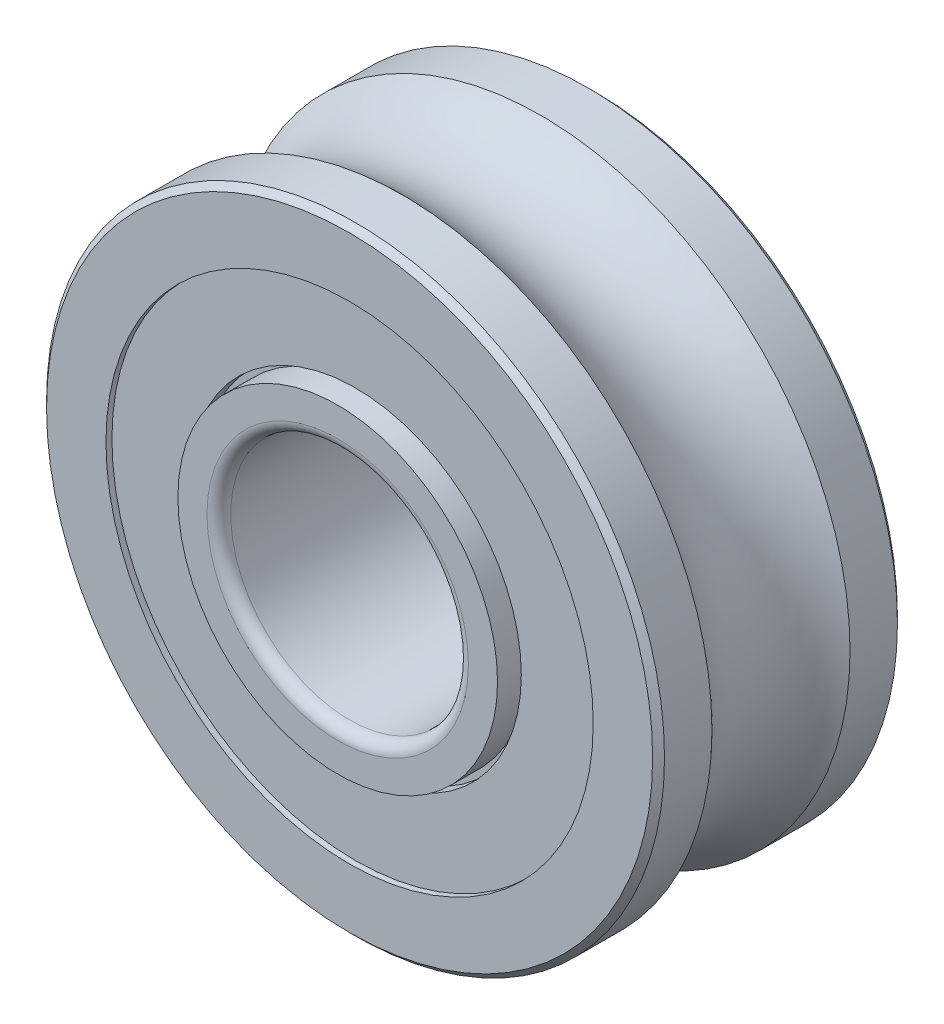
ISO-10303-21;
HEADER;
FILE_DESCRIPTION(('STEP AP214'),'2;1');
FILE_NAME('part.step','',(''),(''),'','','');
FILE_SCHEMA(('AUTOMOTIVE_DESIGN { 1 0 10303 214 1 1 1 1 }'));
ENDSEC;
DATA;
#1=APPLICATION_CONTEXT('core data for automotive mechanical design processes');
#2=APPLICATION_PROTOCOL_DEFINITION('international standard','automotive_design',2000,#1);
#3=PRODUCT_CONTEXT('',#1,'mechanical');
#4=PRODUCT('Part','Part','',(#3));
#5=PRODUCT_RELATED_PRODUCT_CATEGORY('part','',(#4));
#6=PRODUCT_DEFINITION_FORMATION('','',#4);
#7=PRODUCT_DEFINITION_CONTEXT('part definition',#1,'design');
#8=PRODUCT_DEFINITION('design','',#6,#7);
#9=PRODUCT_DEFINITION_SHAPE('','',#8);
#10=(LENGTH_UNIT() NAMED_UNIT(*) SI_UNIT(.MILLI.,.METRE.));
#11=(NAMED_UNIT(*) PLANE_ANGLE_UNIT() SI_UNIT($,.RADIAN.));
#12=(NAMED_UNIT(*) SI_UNIT($,.STERADIAN.) SOLID_ANGLE_UNIT());
#13=UNCERTAINTY_MEASURE_WITH_UNIT(LENGTH_MEASURE(1.E-05),#10,'distance_accuracy_value','');
#14=(GEOMETRIC_REPRESENTATION_CONTEXT(3) GLOBAL_UNCERTAINTY_ASSIGNED_CONTEXT((#13)) GLOBAL_UNIT_ASSIGNED_CONTEXT((#10,
#11,#12)) REPRESENTATION_CONTEXT('',''));
#15=CARTESIAN_POINT('',(0.,0.,0.));
#16=DIRECTION('',(0.,0.,1.));
#17=DIRECTION('',(1.,0.,0.));
#18=AXIS2_PLACEMENT_3D('',#15,#16,#17);
#19=CARTESIAN_POINT('',(0.,0.,38.6779652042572));
#20=DIRECTION('',(0.,0.,1.));
#21=DIRECTION('',(1.,0.,0.));
#22=AXIS2_PLACEMENT_3D('',#19,#20,#21);
#23=CYLINDRICAL_SURFACE('',#22,13.45);
#24=CARTESIAN_POINT('',(0.,0.,-8.8));
#25=DIRECTION('',(0.,0.,1.));
#26=DIRECTION('',(1.,0.,0.));
#27=AXIS2_PLACEMENT_3D('',#24,#25,#26);
#28=CIRCLE('',#27,13.45);
#29=CARTESIAN_POINT('',(13.45,0.,-8.8));
#30=VERTEX_POINT('',#29);
#31=EDGE_CURVE('E194',#30,#30,#28,.F.);
#32=ORIENTED_EDGE('',*,*,#31,.T.);
#33=EDGE_LOOP('',(#32));
#34=FACE_BOUND('',#33,.T.);
#35=CARTESIAN_POINT('',(0.,0.,-11.3));
#36=DIRECTION('',(0.,0.,1.));
#37=DIRECTION('',(1.,0.,0.));
#38=AXIS2_PLACEMENT_3D('',#35,#36,#37);
#39=CIRCLE('',#38,13.45);
#40=CARTESIAN_POINT('',(13.45,0.,-11.3));
#41=VERTEX_POINT('',#40);
#42=EDGE_CURVE('E197',#41,#41,#39,.T.);
#43=ORIENTED_EDGE('',*,*,#42,.T.);
#44=EDGE_LOOP('',(#43));
#45=FACE_BOUND('',#44,.T.);
#46=ADVANCED_FACE('F14',(#34,#45),#23,.T.);
#47=CARTESIAN_POINT('',(0.,13.45,-8.8));
#48=DIRECTION('',(0.,0.,1.));
#49=DIRECTION('',(1.,0.,0.));
#50=AXIS2_PLACEMENT_3D('',#47,#48,#49);
#51=PLANE('',#50);
#52=ORIENTED_EDGE('',*,*,#31,.F.);
#53=EDGE_LOOP('',(#52));
#54=FACE_BOUND('',#53,.T.);
#55=CARTESIAN_POINT('',(0.,0.,-8.8));
#56=DIRECTION('',(0.,0.,1.));
#57=DIRECTION('',(1.,0.,0.));
#58=AXIS2_PLACEMENT_3D('',#55,#56,#57);
#59=CIRCLE('',#58,13.95);
#60=CARTESIAN_POINT('',(13.95,0.,-8.8));
#61=VERTEX_POINT('',#60);
#62=EDGE_CURVE('E56',#61,#61,#59,.F.);
#63=ORIENTED_EDGE('',*,*,#62,.T.);
#64=EDGE_LOOP('',(#63));
#65=FACE_BOUND('',#64,.T.);
#66=ADVANCED_FACE('F73',(#54,#65),#51,.F.);
#67=CARTESIAN_POINT('',(0.,13.45,-11.3));
#68=DIRECTION('',(0.,0.,1.));
#69=DIRECTION('',(1.,0.,0.));
#70=AXIS2_PLACEMENT_3D('',#67,#68,#69);
#71=PLANE('',#70);
#72=CARTESIAN_POINT('',(0.,0.,-11.3));
#73=DIRECTION('',(0.,0.,-1.));
#74=DIRECTION('',(1.,0.,0.));
#75=AXIS2_PLACEMENT_3D('',#72,#73,#74);
#76=CIRCLE('',#75,11.);
#77=CARTESIAN_POINT('',(11.,0.,-11.3));
#78=VERTEX_POINT('',#77);
#79=CARTESIAN_POINT('',(-11.,0.,-11.3));
#80=VERTEX_POINT('',#79);
#81=EDGE_CURVE('E42',#78,#80,#76,.T.);
#82=ORIENTED_EDGE('',*,*,#81,.F.);
#83=CARTESIAN_POINT('',(0.,0.,-11.3));
#84=DIRECTION('',(0.,0.,-1.));
#85=DIRECTION('',(-1.,0.,0.));
#86=AXIS2_PLACEMENT_3D('',#83,#84,#85);
#87=CIRCLE('',#86,11.);
#88=EDGE_CURVE('E44',#80,#78,#87,.T.);
#89=ORIENTED_EDGE('',*,*,#88,.F.);
#90=EDGE_LOOP('',(#82,#89));
#91=FACE_BOUND('',#90,.T.);
#92=ORIENTED_EDGE('',*,*,#42,.F.);
#93=EDGE_LOOP('',(#92));
#94=FACE_BOUND('',#93,.T.);
#95=ADVANCED_FACE('F54',(#91,#94),#71,.F.);
#96=CARTESIAN_POINT('',(0.,0.,38.6779652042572));
#97=DIRECTION('',(0.,0.,1.));
#98=DIRECTION('',(1.,0.,0.));
#99=AXIS2_PLACEMENT_3D('',#96,#97,#98);
#100=CYLINDRICAL_SURFACE('',#99,13.95);
#101=CARTESIAN_POINT('',(0.,0.,-9.8));
#102=DIRECTION('',(0.,0.,1.));
#103=DIRECTION('',(1.,0.,0.));
#104=AXIS2_PLACEMENT_3D('',#101,#102,#103);
#105=CIRCLE('',#104,13.95);
#106=CARTESIAN_POINT('',(13.95,0.,-9.8));
#107=VERTEX_POINT('',#106);
#108=EDGE_CURVE('E50',#107,#107,#105,.F.);
#109=ORIENTED_EDGE('',*,*,#108,.T.);
#110=EDGE_LOOP('',(#109));
#111=FACE_BOUND('',#110,.T.);
#112=ORIENTED_EDGE('',*,*,#62,.F.);
#113=EDGE_LOOP('',(#112));
#114=FACE_BOUND('',#113,.T.);
#115=ADVANCED_FACE('F72',(#111,#114),#100,.F.);
#116=CARTESIAN_POINT('',(0.,0.,-10.3));
#117=DIRECTION('',(0.,0.,1.));
#118=DIRECTION('',(1.,0.,0.));
#119=AXIS2_PLACEMENT_3D('',#116,#117,#118);
#120=TOROIDAL_SURFACE('',#119,11.,1.);
#121=ORIENTED_EDGE('',*,*,#81,.T.);
#122=ORIENTED_EDGE('',*,*,#88,.T.);
#123=EDGE_LOOP('',(#121,#122));
#124=FACE_BOUND('',#123,.T.);
#125=CARTESIAN_POINT('',(0.,0.,-10.3));
#126=DIRECTION('',(0.,0.,1.));
#127=DIRECTION('',(1.,0.,0.));
#128=AXIS2_PLACEMENT_3D('',#125,#126,#127);
#129=CIRCLE('',#128,10.);
#130=CARTESIAN_POINT('',(10.,0.,-10.3));
#131=VERTEX_POINT('',#130);
#132=EDGE_CURVE('E204',#131,#131,#129,.T.);
#133=ORIENTED_EDGE('',*,*,#132,.T.);
#134=EDGE_LOOP('',(#133));
#135=FACE_BOUND('',#134,.T.);
#136=ADVANCED_FACE('F46',(#124,#135),#120,.T.);
#137=CARTESIAN_POINT('',(0.,20.5,-9.8));
#138=DIRECTION('',(0.,0.,1.));
#139=DIRECTION('',(1.,0.,0.));
#140=AXIS2_PLACEMENT_3D('',#137,#138,#139);
#141=PLANE('',#140);
#142=ORIENTED_EDGE('',*,*,#108,.F.);
#143=EDGE_LOOP('',(#142));
#144=FACE_BOUND('',#143,.T.);
#145=CARTESIAN_POINT('',(0.,0.,-9.8));
#146=DIRECTION('',(0.,0.,1.));
#147=DIRECTION('',(1.,0.,0.));
#148=AXIS2_PLACEMENT_3D('',#145,#146,#147);
#149=CIRCLE('',#148,20.5);
#150=CARTESIAN_POINT('',(20.5,0.,-9.8));
#151=VERTEX_POINT('',#150);
#152=EDGE_CURVE('E205',#151,#151,#149,.F.);
#153=ORIENTED_EDGE('',*,*,#152,.T.);
#154=EDGE_LOOP('',(#153));
#155=FACE_BOUND('',#154,.T.);
#156=ADVANCED_FACE('F239',(#144,#155),#141,.F.);
#157=CARTESIAN_POINT('',(0.,0.,38.6779652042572));
#158=DIRECTION('',(0.,0.,1.));
#159=DIRECTION('',(1.,0.,0.));
#160=AXIS2_PLACEMENT_3D('',#157,#158,#159);
#161=CYLINDRICAL_SURFACE('',#160,10.);
#162=ORIENTED_EDGE('',*,*,#132,.F.);
#163=EDGE_LOOP('',(#162));
#164=FACE_BOUND('',#163,.T.);
#165=CARTESIAN_POINT('',(0.,0.,10.3));
#166=DIRECTION('',(0.,0.,1.));
#167=DIRECTION('',(1.,0.,0.));
#168=AXIS2_PLACEMENT_3D('',#165,#166,#167);
#169=CIRCLE('',#168,10.);
#170=CARTESIAN_POINT('',(10.,0.,10.3));
#171=VERTEX_POINT('',#170);
#172=EDGE_CURVE('E208',#171,#171,#169,.F.);
#173=ORIENTED_EDGE('',*,*,#172,.F.);
#174=EDGE_LOOP('',(#173));
#175=FACE_BOUND('',#174,.T.);
#176=ADVANCED_FACE('F242',(#164,#175),#161,.F.);
#177=CARTESIAN_POINT('',(0.,0.,38.6779652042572));
#178=DIRECTION('',(0.,0.,1.));
#179=DIRECTION('',(1.,0.,0.));
#180=AXIS2_PLACEMENT_3D('',#177,#178,#179);
#181=CYLINDRICAL_SURFACE('',#180,20.5);
#182=CARTESIAN_POINT('',(0.,0.,-10.3));
#183=DIRECTION('',(0.,0.,1.));
#184=DIRECTION('',(1.,0.,0.));
#185=AXIS2_PLACEMENT_3D('',#182,#183,#184);
#186=CIRCLE('',#185,20.5);
#187=CARTESIAN_POINT('',(20.5,0.,-10.3));
#188=VERTEX_POINT('',#187);
#189=EDGE_CURVE('E209',#188,#188,#186,.F.);
#190=ORIENTED_EDGE('',*,*,#189,.T.);
#191=EDGE_LOOP('',(#190));
#192=FACE_BOUND('',#191,.T.);
#193=ORIENTED_EDGE('',*,*,#152,.F.);
#194=EDGE_LOOP('',(#193));
#195=FACE_BOUND('',#194,.T.);
#196=ADVANCED_FACE('F176',(#192,#195),#181,.F.);
#197=CARTESIAN_POINT('',(0.,0.,10.3));
#198=DIRECTION('',(0.,0.,1.));
#199=DIRECTION('',(1.,0.,0.));
#200=AXIS2_PLACEMENT_3D('',#197,#198,#199);
#201=TOROIDAL_SURFACE('',#200,11.,1.);
#202=ORIENTED_EDGE('',*,*,#172,.T.);
#203=EDGE_LOOP('',(#202));
#204=FACE_BOUND('',#203,.T.);
#205=CARTESIAN_POINT('',(0.,0.,11.3));
#206=DIRECTION('',(0.,0.,1.));
#207=DIRECTION('',(1.,0.,0.));
#208=AXIS2_PLACEMENT_3D('',#205,#206,#207);
#209=CIRCLE('',#208,11.);
#210=CARTESIAN_POINT('',(11.,0.,11.3));
#211=VERTEX_POINT('',#210);
#212=CARTESIAN_POINT('',(-11.,0.,11.3));
#213=VERTEX_POINT('',#212);
#214=EDGE_CURVE('E33',#211,#213,#209,.T.);
#215=ORIENTED_EDGE('',*,*,#214,.T.);
#216=CARTESIAN_POINT('',(0.,0.,11.3));
#217=DIRECTION('',(0.,0.,1.));
#218=DIRECTION('',(-1.,0.,0.));
#219=AXIS2_PLACEMENT_3D('',#216,#217,#218);
#220=CIRCLE('',#219,11.);
#221=EDGE_CURVE('E140',#213,#211,#220,.T.);
#222=ORIENTED_EDGE('',*,*,#221,.T.);
#223=EDGE_LOOP('',(#215,#222));
#224=FACE_BOUND('',#223,.T.);
#225=ADVANCED_FACE('F172',(#204,#224),#201,.T.);
#226=CARTESIAN_POINT('',(0.,25.5,-10.3));
#227=DIRECTION('',(0.,0.,1.));
#228=DIRECTION('',(1.,0.,0.));
#229=AXIS2_PLACEMENT_3D('',#226,#227,#228);
#230=PLANE('',#229);
#231=ORIENTED_EDGE('',*,*,#189,.F.);
#232=EDGE_LOOP('',(#231));
#233=FACE_BOUND('',#232,.T.);
#234=CARTESIAN_POINT('',(0.,0.,-10.3));
#235=DIRECTION('',(0.,0.,1.));
#236=DIRECTION('',(1.,0.,0.));
#237=AXIS2_PLACEMENT_3D('',#234,#235,#236);
#238=CIRCLE('',#237,25.5);
#239=CARTESIAN_POINT('',(25.5,0.,-10.3));
#240=VERTEX_POINT('',#239);
#241=EDGE_CURVE('E212',#240,#240,#238,.T.);
#242=ORIENTED_EDGE('',*,*,#241,.F.);
#243=EDGE_LOOP('',(#242));
#244=FACE_BOUND('',#243,.T.);
#245=ADVANCED_FACE('F156',(#233,#244),#230,.F.);
#246=CARTESIAN_POINT('',(0.,13.45,11.3));
#247=DIRECTION('',(0.,0.,-1.));
#248=DIRECTION('',(-1.,0.,0.));
#249=AXIS2_PLACEMENT_3D('',#246,#247,#248);
#250=PLANE('',#249);
#251=CARTESIAN_POINT('',(0.,0.,11.3));
#252=DIRECTION('',(0.,0.,1.));
#253=DIRECTION('',(1.,0.,0.));
#254=AXIS2_PLACEMENT_3D('',#251,#252,#253);
#255=CIRCLE('',#254,13.45);
#256=CARTESIAN_POINT('',(13.45,0.,11.3));
#257=VERTEX_POINT('',#256);
#258=EDGE_CURVE('E138',#257,#257,#255,.F.);
#259=ORIENTED_EDGE('',*,*,#258,.F.);
#260=EDGE_LOOP('',(#259));
#261=FACE_BOUND('',#260,.T.);
#262=ORIENTED_EDGE('',*,*,#221,.F.);
#263=ORIENTED_EDGE('',*,*,#214,.F.);
#264=EDGE_LOOP('',(#262,#263));
#265=FACE_BOUND('',#264,.T.);
#266=ADVANCED_FACE('F145',(#261,#265),#250,.F.);
#267=CARTESIAN_POINT('',(0.,0.,-9.8));
#268=DIRECTION('',(0.,0.,1.));
#269=DIRECTION('',(1.,0.,0.));
#270=AXIS2_PLACEMENT_3D('',#267,#268,#269);
#271=CONICAL_SURFACE('',#270,26.,0.785398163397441);
#272=ORIENTED_EDGE('',*,*,#241,.T.);
#273=EDGE_LOOP('',(#272));
#274=FACE_BOUND('',#273,.T.);
#275=CARTESIAN_POINT('',(0.,0.,-9.8));
#276=DIRECTION('',(0.,0.,1.));
#277=DIRECTION('',(1.,0.,0.));
#278=AXIS2_PLACEMENT_3D('',#275,#276,#277);
#279=CIRCLE('',#278,26.);
#280=CARTESIAN_POINT('',(26.,0.,-9.8));
#281=VERTEX_POINT('',#280);
#282=EDGE_CURVE('E135',#281,#281,#279,.T.);
#283=ORIENTED_EDGE('',*,*,#282,.F.);
#284=EDGE_LOOP('',(#283));
#285=FACE_BOUND('',#284,.T.);
#286=ADVANCED_FACE('F155',(#274,#285),#271,.T.);
#287=CARTESIAN_POINT('',(0.,0.,38.6779652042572));
#288=DIRECTION('',(0.,0.,1.));
#289=DIRECTION('',(1.,0.,0.));
#290=AXIS2_PLACEMENT_3D('',#287,#288,#289);
#291=CYLINDRICAL_SURFACE('',#290,13.45);
#292=ORIENTED_EDGE('',*,*,#258,.T.);
#293=EDGE_LOOP('',(#292));
#294=FACE_BOUND('',#293,.T.);
#295=CARTESIAN_POINT('',(0.,0.,8.8));
#296=DIRECTION('',(0.,0.,1.));
#297=DIRECTION('',(1.,0.,0.));
#298=AXIS2_PLACEMENT_3D('',#295,#296,#297);
#299=CIRCLE('',#298,13.45);
#300=CARTESIAN_POINT('',(13.45,0.,8.8));
#301=VERTEX_POINT('',#300);
#302=EDGE_CURVE('E134',#301,#301,#299,.T.);
#303=ORIENTED_EDGE('',*,*,#302,.T.);
#304=EDGE_LOOP('',(#303));
#305=FACE_BOUND('',#304,.T.);
#306=ADVANCED_FACE('F270',(#294,#305),#291,.T.);
#307=CARTESIAN_POINT('',(0.,0.,38.6779652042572));
#308=DIRECTION('',(0.,0.,1.));
#309=DIRECTION('',(1.,0.,0.));
#310=AXIS2_PLACEMENT_3D('',#307,#308,#309);
#311=CYLINDRICAL_SURFACE('',#310,26.);
#312=ORIENTED_EDGE('',*,*,#282,.T.);
#313=EDGE_LOOP('',(#312));
#314=FACE_BOUND('',#313,.T.);
#315=CARTESIAN_POINT('',(0.,0.,-5.80947501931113));
#316=DIRECTION('',(0.,0.,1.));
#317=DIRECTION('',(1.,0.,0.));
#318=AXIS2_PLACEMENT_3D('',#315,#316,#317);
#319=CIRCLE('',#318,26.);
#320=CARTESIAN_POINT('',(26.,0.,-5.80947501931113));
#321=VERTEX_POINT('',#320);
#322=EDGE_CURVE('E130',#321,#321,#319,.F.);
#323=ORIENTED_EDGE('',*,*,#322,.T.);
#324=EDGE_LOOP('',(#323));
#325=FACE_BOUND('',#324,.T.);
#326=ADVANCED_FACE('F273',(#314,#325),#311,.T.);
#327=CARTESIAN_POINT('',(0.,13.45,8.8));
#328=DIRECTION('',(0.,0.,-1.));
#329=DIRECTION('',(-1.,0.,0.));
#330=AXIS2_PLACEMENT_3D('',#327,#328,#329);
#331=PLANE('',#330);
#332=CARTESIAN_POINT('',(0.,0.,8.8));
#333=DIRECTION('',(0.,0.,1.));
#334=DIRECTION('',(1.,0.,0.));
#335=AXIS2_PLACEMENT_3D('',#332,#333,#334);
#336=CIRCLE('',#335,13.95);
#337=CARTESIAN_POINT('',(13.95,0.,8.8));
#338=VERTEX_POINT('',#337);
#339=EDGE_CURVE('E133',#338,#338,#336,.T.);
#340=ORIENTED_EDGE('',*,*,#339,.T.);
#341=EDGE_LOOP('',(#340));
#342=FACE_BOUND('',#341,.T.);
#343=ORIENTED_EDGE('',*,*,#302,.F.);
#344=EDGE_LOOP('',(#343));
#345=FACE_BOUND('',#344,.T.);
#346=ADVANCED_FACE('F276',(#342,#345),#331,.F.);
#347=CARTESIAN_POINT('',(0.,0.,38.6779652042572));
#348=DIRECTION('',(0.,0.,1.));
#349=DIRECTION('',(1.,0.,0.));
#350=AXIS2_PLACEMENT_3D('',#347,#348,#349);
#351=CYLINDRICAL_SURFACE('',#350,13.95);
#352=ORIENTED_EDGE('',*,*,#339,.F.);
#353=EDGE_LOOP('',(#352));
#354=FACE_BOUND('',#353,.T.);
#355=CARTESIAN_POINT('',(0.,0.,9.8));
#356=DIRECTION('',(0.,0.,1.));
#357=DIRECTION('',(1.,0.,0.));
#358=AXIS2_PLACEMENT_3D('',#355,#356,#357);
#359=CIRCLE('',#358,13.95);
#360=CARTESIAN_POINT('',(13.95,0.,9.8));
#361=VERTEX_POINT('',#360);
#362=EDGE_CURVE('E221',#361,#361,#359,.T.);
#363=ORIENTED_EDGE('',*,*,#362,.T.);
#364=EDGE_LOOP('',(#363));
#365=FACE_BOUND('',#364,.T.);
#366=ADVANCED_FACE('F122',(#354,#365),#351,.F.);
#367=CARTESIAN_POINT('',(0.,0.,0.));
#368=DIRECTION('',(0.,0.,1.));
#369=DIRECTION('',(1.,0.,0.));
#370=AXIS2_PLACEMENT_3D('',#367,#368,#369);
#371=TOROIDAL_SURFACE('',#370,31.5,8.);
#372=ORIENTED_EDGE('',*,*,#322,.F.);
#373=EDGE_LOOP('',(#372));
#374=FACE_BOUND('',#373,.T.);
#375=CARTESIAN_POINT('',(0.,0.,5.80947501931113));
#376=DIRECTION('',(0.,0.,1.));
#377=DIRECTION('',(1.,0.,0.));
#378=AXIS2_PLACEMENT_3D('',#375,#376,#377);
#379=CIRCLE('',#378,26.);
#380=CARTESIAN_POINT('',(26.,0.,5.80947501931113));
#381=VERTEX_POINT('',#380);
#382=EDGE_CURVE('E128',#381,#381,#379,.T.);
#383=ORIENTED_EDGE('',*,*,#382,.F.);
#384=EDGE_LOOP('',(#383));
#385=FACE_BOUND('',#384,.T.);
#386=ADVANCED_FACE('F117',(#374,#385),#371,.F.);
#387=CARTESIAN_POINT('',(0.,20.5,9.8));
#388=DIRECTION('',(0.,0.,-1.));
#389=DIRECTION('',(-1.,0.,0.));
#390=AXIS2_PLACEMENT_3D('',#387,#388,#389);
#391=PLANE('',#390);
#392=CARTESIAN_POINT('',(0.,0.,9.8));
#393=DIRECTION('',(0.,0.,1.));
#394=DIRECTION('',(1.,0.,0.));
#395=AXIS2_PLACEMENT_3D('',#392,#393,#394);
#396=CIRCLE('',#395,20.5);
#397=CARTESIAN_POINT('',(20.5,0.,9.8));
#398=VERTEX_POINT('',#397);
#399=EDGE_CURVE('E224',#398,#398,#396,.T.);
#400=ORIENTED_EDGE('',*,*,#399,.T.);
#401=EDGE_LOOP('',(#400));
#402=FACE_BOUND('',#401,.T.);
#403=ORIENTED_EDGE('',*,*,#362,.F.);
#404=EDGE_LOOP('',(#403));
#405=FACE_BOUND('',#404,.T.);
#406=ADVANCED_FACE('F113',(#402,#405),#391,.F.);
#407=CARTESIAN_POINT('',(0.,0.,38.6779652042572));
#408=DIRECTION('',(0.,0.,1.));
#409=DIRECTION('',(1.,0.,0.));
#410=AXIS2_PLACEMENT_3D('',#407,#408,#409);
#411=CYLINDRICAL_SURFACE('',#410,26.);
#412=ORIENTED_EDGE('',*,*,#382,.T.);
#413=EDGE_LOOP('',(#412));
#414=FACE_BOUND('',#413,.T.);
#415=CARTESIAN_POINT('',(0.,0.,9.8));
#416=DIRECTION('',(0.,0.,-1.));
#417=DIRECTION('',(-1.,0.,0.));
#418=AXIS2_PLACEMENT_3D('',#415,#416,#417);
#419=CIRCLE('',#418,26.);
#420=CARTESIAN_POINT('',(-26.,0.,9.8));
#421=VERTEX_POINT('',#420);
#422=EDGE_CURVE('E227',#421,#421,#419,.F.);
#423=ORIENTED_EDGE('',*,*,#422,.F.);
#424=EDGE_LOOP('',(#423));
#425=FACE_BOUND('',#424,.T.);
#426=ADVANCED_FACE('F109',(#414,#425),#411,.T.);
#427=CARTESIAN_POINT('',(0.,0.,38.6779652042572));
#428=DIRECTION('',(0.,0.,1.));
#429=DIRECTION('',(1.,0.,0.));
#430=AXIS2_PLACEMENT_3D('',#427,#428,#429);
#431=CYLINDRICAL_SURFACE('',#430,20.5);
#432=ORIENTED_EDGE('',*,*,#399,.F.);
#433=EDGE_LOOP('',(#432));
#434=FACE_BOUND('',#433,.T.);
#435=CARTESIAN_POINT('',(0.,0.,10.3));
#436=DIRECTION('',(0.,0.,1.));
#437=DIRECTION('',(1.,0.,0.));
#438=AXIS2_PLACEMENT_3D('',#435,#436,#437);
#439=CIRCLE('',#438,20.5);
#440=CARTESIAN_POINT('',(20.5,0.,10.3));
#441=VERTEX_POINT('',#440);
#442=EDGE_CURVE('E25',#441,#441,#439,.T.);
#443=ORIENTED_EDGE('',*,*,#442,.T.);
#444=EDGE_LOOP('',(#443));
#445=FACE_BOUND('',#444,.T.);
#446=ADVANCED_FACE('F101',(#434,#445),#431,.F.);
#447=CARTESIAN_POINT('',(0.,0.,9.8));
#448=DIRECTION('',(0.,0.,-1.));
#449=DIRECTION('',(-1.,0.,0.));
#450=AXIS2_PLACEMENT_3D('',#447,#448,#449);
#451=CONICAL_SURFACE('',#450,26.,0.785398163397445);
#452=CARTESIAN_POINT('',(0.,0.,10.3));
#453=DIRECTION('',(0.,0.,-1.));
#454=DIRECTION('',(-1.,0.,0.));
#455=AXIS2_PLACEMENT_3D('',#452,#453,#454);
#456=CIRCLE('',#455,25.5);
#457=CARTESIAN_POINT('',(-25.5,0.,10.3));
#458=VERTEX_POINT('',#457);
#459=EDGE_CURVE('E9',#458,#458,#456,.T.);
#460=ORIENTED_EDGE('',*,*,#459,.T.);
#461=EDGE_LOOP('',(#460));
#462=FACE_BOUND('',#461,.T.);
#463=ORIENTED_EDGE('',*,*,#422,.T.);
#464=EDGE_LOOP('',(#463));
#465=FACE_BOUND('',#464,.T.);
#466=ADVANCED_FACE('F94',(#462,#465),#451,.T.);
#467=CARTESIAN_POINT('',(0.,25.5,10.3));
#468=DIRECTION('',(0.,0.,-1.));
#469=DIRECTION('',(-1.,0.,0.));
#470=AXIS2_PLACEMENT_3D('',#467,#468,#469);
#471=PLANE('',#470);
#472=ORIENTED_EDGE('',*,*,#459,.F.);
#473=EDGE_LOOP('',(#472));
#474=FACE_BOUND('',#473,.T.);
#475=ORIENTED_EDGE('',*,*,#442,.F.);
#476=EDGE_LOOP('',(#475));
#477=FACE_BOUND('',#476,.T.);
#478=ADVANCED_FACE('F92',(#474,#477),#471,.F.);
#479=CLOSED_SHELL('',(#46,#66,#95,#115,#136,#156,#176,#196,#225,#245,#266,#286,#306,#326,#346,
#366,#386,#406,#426,#446,#466,#478));
#480=MANIFOLD_SOLID_BREP('B1',#479);
#481=ADVANCED_BREP_SHAPE_REPRESENTATION('',(#18,#480),#14);
#482=SHAPE_DEFINITION_REPRESENTATION(#9,#481);
ENDSEC;
END-ISO-10303-21;
